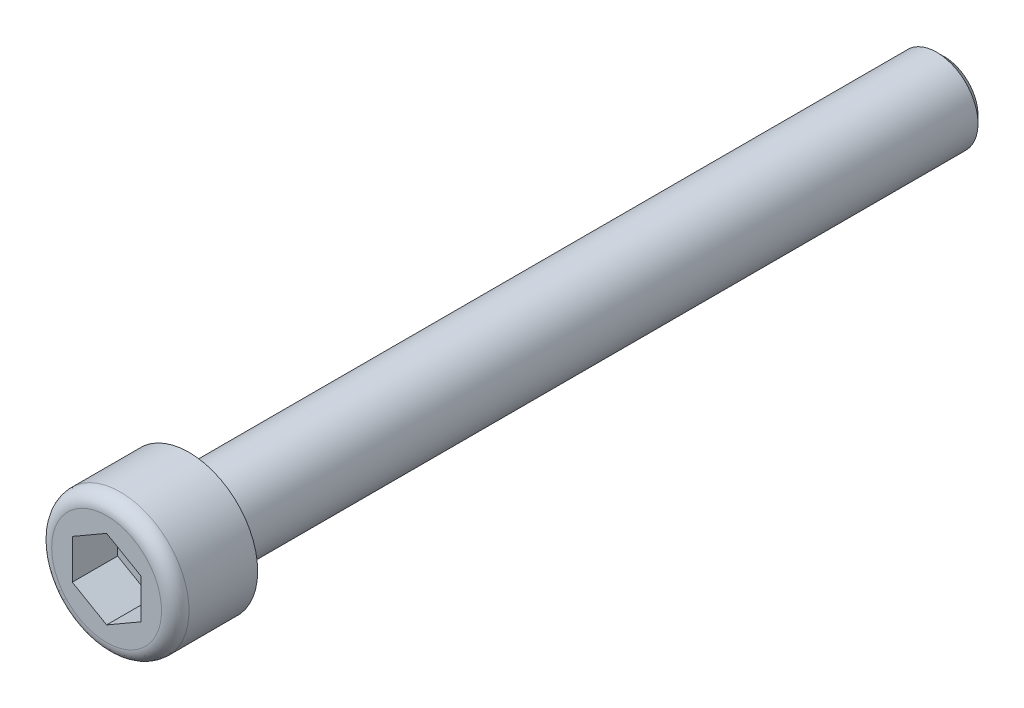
ISO-10303-21;
HEADER;
FILE_DESCRIPTION(('STEP AP214'),'2;1');
FILE_NAME('part.step','',(''),(''),'','','');
FILE_SCHEMA(('AUTOMOTIVE_DESIGN { 1 0 10303 214 1 1 1 1 }'));
ENDSEC;
DATA;
#1=APPLICATION_CONTEXT('core data for automotive mechanical design processes');
#2=APPLICATION_PROTOCOL_DEFINITION('international standard','automotive_design',2000,#1);
#3=PRODUCT_CONTEXT('',#1,'mechanical');
#4=PRODUCT('Part','Part','',(#3));
#5=PRODUCT_RELATED_PRODUCT_CATEGORY('part','',(#4));
#6=PRODUCT_DEFINITION_FORMATION('','',#4);
#7=PRODUCT_DEFINITION_CONTEXT('part definition',#1,'design');
#8=PRODUCT_DEFINITION('design','',#6,#7);
#9=PRODUCT_DEFINITION_SHAPE('','',#8);
#10=(LENGTH_UNIT() NAMED_UNIT(*) SI_UNIT(.MILLI.,.METRE.));
#11=(NAMED_UNIT(*) PLANE_ANGLE_UNIT() SI_UNIT($,.RADIAN.));
#12=(NAMED_UNIT(*) SI_UNIT($,.STERADIAN.) SOLID_ANGLE_UNIT());
#13=UNCERTAINTY_MEASURE_WITH_UNIT(LENGTH_MEASURE(1.E-05),#10,'distance_accuracy_value','');
#14=(GEOMETRIC_REPRESENTATION_CONTEXT(3) GLOBAL_UNCERTAINTY_ASSIGNED_CONTEXT((#13)) GLOBAL_UNIT_ASSIGNED_CONTEXT((#10,
#11,#12)) REPRESENTATION_CONTEXT('',''));
#15=CARTESIAN_POINT('',(0.,0.,0.));
#16=DIRECTION('',(0.,0.,1.));
#17=DIRECTION('',(1.,0.,0.));
#18=AXIS2_PLACEMENT_3D('',#15,#16,#17);
#19=CARTESIAN_POINT('',(0.,0.,0.));
#20=DIRECTION('',(0.,0.,-1.));
#21=DIRECTION('',(0.,1.,0.));
#22=AXIS2_PLACEMENT_3D('',#19,#20,#21);
#23=CYLINDRICAL_SURFACE('',#22,3.);
#24=CARTESIAN_POINT('',(0.,0.,0.));
#25=DIRECTION('',(0.,0.,-1.));
#26=DIRECTION('',(0.,1.,0.));
#27=AXIS2_PLACEMENT_3D('',#24,#25,#26);
#28=CIRCLE('',#27,3.);
#29=CARTESIAN_POINT('',(0.,3.,0.));
#30=VERTEX_POINT('',#29);
#31=EDGE_CURVE('E9',#30,#30,#28,.T.);
#32=ORIENTED_EDGE('',*,*,#31,.T.);
#33=EDGE_LOOP('',(#32));
#34=FACE_BOUND('',#33,.T.);
#35=CARTESIAN_POINT('',(0.,1.90141819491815E-13,-54.45875));
#36=DIRECTION('',(0.,0.,-1.));
#37=DIRECTION('',(-1.,0.,0.));
#38=AXIS2_PLACEMENT_3D('',#35,#36,#37);
#39=CIRCLE('',#38,3.);
#40=CARTESIAN_POINT('',(-3.,1.90141819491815E-13,-54.45875));
#41=VERTEX_POINT('',#40);
#42=EDGE_CURVE('E108',#41,#41,#39,.T.);
#43=ORIENTED_EDGE('',*,*,#42,.F.);
#44=EDGE_LOOP('',(#43));
#45=FACE_BOUND('',#44,.T.);
#46=ADVANCED_FACE('F14',(#34,#45),#23,.T.);
#47=CARTESIAN_POINT('',(3.25,-3.315,0.));
#48=DIRECTION('',(0.,0.,-1.));
#49=DIRECTION('',(-1.,0.,0.));
#50=AXIS2_PLACEMENT_3D('',#47,#48,#49);
#51=PLANE('',#50);
#52=ORIENTED_EDGE('',*,*,#31,.F.);
#53=EDGE_LOOP('',(#52));
#54=FACE_BOUND('',#53,.T.);
#55=CARTESIAN_POINT('',(0.,0.,0.));
#56=DIRECTION('',(0.,0.,1.));
#57=DIRECTION('',(1.,0.,0.));
#58=AXIS2_PLACEMENT_3D('',#55,#56,#57);
#59=CIRCLE('',#58,5.);
#60=CARTESIAN_POINT('',(5.,0.,0.));
#61=VERTEX_POINT('',#60);
#62=EDGE_CURVE('E109',#61,#61,#59,.T.);
#63=ORIENTED_EDGE('',*,*,#62,.F.);
#64=EDGE_LOOP('',(#63));
#65=FACE_BOUND('',#64,.T.);
#66=ADVANCED_FACE('F16',(#54,#65),#51,.T.);
#67=CARTESIAN_POINT('',(-2.5,2.88675134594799,2.7));
#68=DIRECTION('',(0.,0.,-1.));
#69=DIRECTION('',(1.,0.,0.));
#70=AXIS2_PLACEMENT_3D('',#67,#68,#69);
#71=PLANE('',#70);
#72=DIRECTION('',(-0.866025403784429,0.500000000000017,0.));
#73=VECTOR('',#72,1.);
#74=CARTESIAN_POINT('',(1.24999999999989,2.16506350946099,2.7));
#75=LINE('',#74,#73);
#76=CARTESIAN_POINT('',(2.49999999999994,1.44337567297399,2.7));
#77=VERTEX_POINT('',#76);
#78=CARTESIAN_POINT('',(-6.98827145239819E-10,2.88675134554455,2.7));
#79=VERTEX_POINT('',#78);
#80=EDGE_CURVE('E157',#77,#79,#75,.T.);
#81=ORIENTED_EDGE('',*,*,#80,.T.);
#82=DIRECTION('',(-0.866025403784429,-0.500000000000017,0.));
#83=VECTOR('',#82,1.);
#84=CARTESIAN_POINT('',(-1.25000000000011,2.16506350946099,2.7));
#85=LINE('',#84,#83);
#86=CARTESIAN_POINT('',(-2.5,1.44337567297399,2.7));
#87=VERTEX_POINT('',#86);
#88=EDGE_CURVE('E154',#79,#87,#85,.T.);
#89=ORIENTED_EDGE('',*,*,#88,.T.);
#90=DIRECTION('',(0.,-1.,0.));
#91=VECTOR('',#90,1.);
#92=CARTESIAN_POINT('',(-2.5,0.,2.7));
#93=LINE('',#92,#91);
#94=CARTESIAN_POINT('',(-2.49999999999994,-1.44337567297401,2.7));
#95=VERTEX_POINT('',#94);
#96=EDGE_CURVE('E151',#87,#95,#93,.T.);
#97=ORIENTED_EDGE('',*,*,#96,.T.);
#98=DIRECTION('',(0.866025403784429,-0.500000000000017,0.));
#99=VECTOR('',#98,1.);
#100=CARTESIAN_POINT('',(-1.24999999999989,-2.16506350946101,2.7));
#101=LINE('',#100,#99);
#102=CARTESIAN_POINT('',(1.39759834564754E-09,-2.88675134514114,2.7));
#103=VERTEX_POINT('',#102);
#104=EDGE_CURVE('E101',#95,#103,#101,.T.);
#105=ORIENTED_EDGE('',*,*,#104,.T.);
#106=DIRECTION('',(0.866025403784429,0.500000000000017,0.));
#107=VECTOR('',#106,1.);
#108=CARTESIAN_POINT('',(1.25000000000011,-2.16506350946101,2.7));
#109=LINE('',#108,#107);
#110=CARTESIAN_POINT('',(2.5,-1.44337567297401,2.7));
#111=VERTEX_POINT('',#110);
#112=EDGE_CURVE('E86',#103,#111,#109,.T.);
#113=ORIENTED_EDGE('',*,*,#112,.T.);
#114=DIRECTION('',(0.,1.,0.));
#115=VECTOR('',#114,1.);
#116=CARTESIAN_POINT('',(2.5,0.,2.7));
#117=LINE('',#116,#115);
#118=EDGE_CURVE('E84',#111,#77,#117,.T.);
#119=ORIENTED_EDGE('',*,*,#118,.T.);
#120=EDGE_LOOP('',(#81,#89,#97,#105,#113,#119));
#121=FACE_BOUND('',#120,.T.);
#122=ADVANCED_FACE('F206',(#121),#71,.F.);
#123=CARTESIAN_POINT('',(0.,-2.88675134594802,6.));
#124=DIRECTION('',(-0.500000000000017,-0.866025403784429,0.));
#125=DIRECTION('',(-0.866025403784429,0.500000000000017,0.));
#126=AXIS2_PLACEMENT_3D('',#123,#124,#125);
#127=PLANE('',#126);
#128=ORIENTED_EDGE('',*,*,#104,.F.);
#129=DIRECTION('',(0.,0.,-1.));
#130=VECTOR('',#129,1.);
#131=CARTESIAN_POINT('',(-2.49999999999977,-1.44337567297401,4.35));
#132=LINE('',#131,#130);
#133=CARTESIAN_POINT('',(-2.49999999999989,-1.44337567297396,6.));
#134=VERTEX_POINT('',#133);
#135=EDGE_CURVE('E150',#134,#95,#132,.T.);
#136=ORIENTED_EDGE('',*,*,#135,.F.);
#137=DIRECTION('',(-0.866025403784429,0.500000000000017,0.));
#138=VECTOR('',#137,1.);
#139=CARTESIAN_POINT('',(0.,-2.88675134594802,6.));
#140=LINE('',#139,#138);
#141=CARTESIAN_POINT('',(0.,-2.88675134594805,6.));
#142=VERTEX_POINT('',#141);
#143=EDGE_CURVE('E194',#134,#142,#140,.F.);
#144=ORIENTED_EDGE('',*,*,#143,.T.);
#145=DIRECTION('',(0.,0.,1.));
#146=VECTOR('',#145,1.);
#147=CARTESIAN_POINT('',(0.,-2.88675134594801,4.35));
#148=LINE('',#147,#146);
#149=EDGE_CURVE('E98',#103,#142,#148,.T.);
#150=ORIENTED_EDGE('',*,*,#149,.F.);
#151=EDGE_LOOP('',(#128,#136,#144,#150));
#152=FACE_BOUND('',#151,.T.);
#153=ADVANCED_FACE('F176',(#152),#127,.F.);
#154=CARTESIAN_POINT('',(2.5,-1.44337567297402,6.));
#155=DIRECTION('',(0.500000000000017,-0.866025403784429,0.));
#156=DIRECTION('',(-0.866025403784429,-0.500000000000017,0.));
#157=AXIS2_PLACEMENT_3D('',#154,#155,#156);
#158=PLANE('',#157);
#159=ORIENTED_EDGE('',*,*,#112,.F.);
#160=ORIENTED_EDGE('',*,*,#149,.T.);
#161=DIRECTION('',(-0.866025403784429,-0.500000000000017,0.));
#162=VECTOR('',#161,1.);
#163=CARTESIAN_POINT('',(2.5,-1.44337567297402,6.));
#164=LINE('',#163,#162);
#165=CARTESIAN_POINT('',(2.5,-1.44337567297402,6.));
#166=VERTEX_POINT('',#165);
#167=EDGE_CURVE('E73',#142,#166,#164,.F.);
#168=ORIENTED_EDGE('',*,*,#167,.T.);
#169=DIRECTION('',(0.,0.,-1.));
#170=VECTOR('',#169,1.);
#171=CARTESIAN_POINT('',(2.5,-1.44337567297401,4.35));
#172=LINE('',#171,#170);
#173=EDGE_CURVE('E80',#166,#111,#172,.T.);
#174=ORIENTED_EDGE('',*,*,#173,.T.);
#175=EDGE_LOOP('',(#159,#160,#168,#174));
#176=FACE_BOUND('',#175,.T.);
#177=ADVANCED_FACE('F96',(#176),#158,.F.);
#178=CARTESIAN_POINT('',(2.5,1.44337567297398,6.));
#179=DIRECTION('',(1.,0.,0.));
#180=DIRECTION('',(0.,-1.,0.));
#181=AXIS2_PLACEMENT_3D('',#178,#179,#180);
#182=PLANE('',#181);
#183=ORIENTED_EDGE('',*,*,#118,.F.);
#184=ORIENTED_EDGE('',*,*,#173,.F.);
#185=DIRECTION('',(0.,1.,0.));
#186=VECTOR('',#185,1.);
#187=CARTESIAN_POINT('',(2.5,0.,6.));
#188=LINE('',#187,#186);
#189=CARTESIAN_POINT('',(2.49999999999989,1.44337567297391,6.));
#190=VERTEX_POINT('',#189);
#191=EDGE_CURVE('E83',#166,#190,#188,.T.);
#192=ORIENTED_EDGE('',*,*,#191,.T.);
#193=DIRECTION('',(0.,0.,-1.));
#194=VECTOR('',#193,1.);
#195=CARTESIAN_POINT('',(2.49999999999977,1.44337567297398,4.35));
#196=LINE('',#195,#194);
#197=EDGE_CURVE('E159',#190,#77,#196,.T.);
#198=ORIENTED_EDGE('',*,*,#197,.T.);
#199=EDGE_LOOP('',(#183,#184,#192,#198));
#200=FACE_BOUND('',#199,.T.);
#201=ADVANCED_FACE('F81',(#200),#182,.F.);
#202=CARTESIAN_POINT('',(0.,2.88675134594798,6.));
#203=DIRECTION('',(0.500000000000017,0.866025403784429,0.));
#204=DIRECTION('',(0.866025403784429,-0.500000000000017,0.));
#205=AXIS2_PLACEMENT_3D('',#202,#203,#204);
#206=PLANE('',#205);
#207=ORIENTED_EDGE('',*,*,#80,.F.);
#208=ORIENTED_EDGE('',*,*,#197,.F.);
#209=DIRECTION('',(0.866025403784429,-0.500000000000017,0.));
#210=VECTOR('',#209,1.);
#211=CARTESIAN_POINT('',(0.,2.88675134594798,6.));
#212=LINE('',#211,#210);
#213=CARTESIAN_POINT('',(-1.67119233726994E-13,2.88675134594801,6.));
#214=VERTEX_POINT('',#213);
#215=EDGE_CURVE('E94',#190,#214,#212,.F.);
#216=ORIENTED_EDGE('',*,*,#215,.T.);
#217=DIRECTION('',(0.,0.,-1.));
#218=VECTOR('',#217,1.);
#219=CARTESIAN_POINT('',(-2.2291196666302E-13,2.88675134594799,4.35));
#220=LINE('',#219,#218);
#221=EDGE_CURVE('E156',#214,#79,#220,.T.);
#222=ORIENTED_EDGE('',*,*,#221,.T.);
#223=EDGE_LOOP('',(#207,#208,#216,#222));
#224=FACE_BOUND('',#223,.T.);
#225=ADVANCED_FACE('F203',(#224),#206,.F.);
#226=CARTESIAN_POINT('',(-2.5,1.44337567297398,6.));
#227=DIRECTION('',(-0.500000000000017,0.866025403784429,0.));
#228=DIRECTION('',(0.866025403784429,0.500000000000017,0.));
#229=AXIS2_PLACEMENT_3D('',#226,#227,#228);
#230=PLANE('',#229);
#231=ORIENTED_EDGE('',*,*,#88,.F.);
#232=ORIENTED_EDGE('',*,*,#221,.F.);
#233=DIRECTION('',(0.866025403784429,0.500000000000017,0.));
#234=VECTOR('',#233,1.);
#235=CARTESIAN_POINT('',(-2.5,1.44337567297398,6.));
#236=LINE('',#235,#234);
#237=CARTESIAN_POINT('',(-2.5,1.44337567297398,6.));
#238=VERTEX_POINT('',#237);
#239=EDGE_CURVE('E195',#214,#238,#236,.F.);
#240=ORIENTED_EDGE('',*,*,#239,.T.);
#241=DIRECTION('',(0.,0.,-1.));
#242=VECTOR('',#241,1.);
#243=CARTESIAN_POINT('',(-2.5,1.44337567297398,4.35));
#244=LINE('',#243,#242);
#245=EDGE_CURVE('E153',#238,#87,#244,.T.);
#246=ORIENTED_EDGE('',*,*,#245,.T.);
#247=EDGE_LOOP('',(#231,#232,#240,#246));
#248=FACE_BOUND('',#247,.T.);
#249=ADVANCED_FACE('F208',(#248),#230,.F.);
#250=CARTESIAN_POINT('',(-2.5,-1.44337567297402,6.));
#251=DIRECTION('',(-1.,0.,0.));
#252=DIRECTION('',(0.,1.,0.));
#253=AXIS2_PLACEMENT_3D('',#250,#251,#252);
#254=PLANE('',#253);
#255=ORIENTED_EDGE('',*,*,#96,.F.);
#256=ORIENTED_EDGE('',*,*,#245,.F.);
#257=DIRECTION('',(0.,-1.,0.));
#258=VECTOR('',#257,1.);
#259=CARTESIAN_POINT('',(-2.5,0.,6.));
#260=LINE('',#259,#258);
#261=EDGE_CURVE('E191',#238,#134,#260,.T.);
#262=ORIENTED_EDGE('',*,*,#261,.T.);
#263=ORIENTED_EDGE('',*,*,#135,.T.);
#264=EDGE_LOOP('',(#255,#256,#262,#263));
#265=FACE_BOUND('',#264,.T.);
#266=ADVANCED_FACE('F175',(#265),#254,.F.);
#267=CARTESIAN_POINT('',(4.,-4.08,6.));
#268=DIRECTION('',(0.,0.,-1.));
#269=DIRECTION('',(-1.,0.,0.));
#270=AXIS2_PLACEMENT_3D('',#267,#268,#269);
#271=PLANE('',#270);
#272=ORIENTED_EDGE('',*,*,#261,.F.);
#273=ORIENTED_EDGE('',*,*,#239,.F.);
#274=ORIENTED_EDGE('',*,*,#215,.F.);
#275=ORIENTED_EDGE('',*,*,#191,.F.);
#276=ORIENTED_EDGE('',*,*,#167,.F.);
#277=ORIENTED_EDGE('',*,*,#143,.F.);
#278=EDGE_LOOP('',(#272,#273,#274,#275,#276,#277));
#279=FACE_BOUND('',#278,.T.);
#280=CARTESIAN_POINT('',(0.,0.,6.));
#281=DIRECTION('',(0.,0.,-1.));
#282=DIRECTION('',(-1.,0.,0.));
#283=AXIS2_PLACEMENT_3D('',#280,#281,#282);
#284=CIRCLE('',#283,4.);
#285=CARTESIAN_POINT('',(4.,0.,6.));
#286=VERTEX_POINT('',#285);
#287=CARTESIAN_POINT('',(-4.,0.,6.));
#288=VERTEX_POINT('',#287);
#289=EDGE_CURVE('E121',#286,#288,#284,.F.);
#290=ORIENTED_EDGE('',*,*,#289,.T.);
#291=CARTESIAN_POINT('',(0.,0.,6.));
#292=DIRECTION('',(0.,0.,-1.));
#293=DIRECTION('',(1.,0.,0.));
#294=AXIS2_PLACEMENT_3D('',#291,#292,#293);
#295=CIRCLE('',#294,4.);
#296=EDGE_CURVE('E34',#288,#286,#295,.F.);
#297=ORIENTED_EDGE('',*,*,#296,.T.);
#298=EDGE_LOOP('',(#290,#297));
#299=FACE_BOUND('',#298,.T.);
#300=ADVANCED_FACE('F90',(#279,#299),#271,.F.);
#301=CARTESIAN_POINT('',(-4.,0.,6.));
#302=CARTESIAN_POINT('',(-4.5857864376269,0.,6.));
#303=CARTESIAN_POINT('',(-5.,0.,5.58578643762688));
#304=CARTESIAN_POINT('',(-5.,0.,5.));
#305=(BOUNDED_CURVE() B_SPLINE_CURVE(3,(#301,#302,#303,#304),.UNSPECIFIED.,.F.,
.F.) B_SPLINE_CURVE_WITH_KNOTS((4,4),(0.,1.),
.UNSPECIFIED.) CURVE() GEOMETRIC_REPRESENTATION_ITEM() RATIONAL_B_SPLINE_CURVE((1.,
0.804737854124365,0.804737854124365,1.)) REPRESENTATION_ITEM(''));
#306=CARTESIAN_POINT('',(0.,0.,5.));
#307=DIRECTION('',(0.,0.,-1.));
#308=AXIS1_PLACEMENT('',#306,#307);
#309=SURFACE_OF_REVOLUTION('',#305,#308);
#310=ORIENTED_EDGE('',*,*,#289,.F.);
#311=ORIENTED_EDGE('',*,*,#296,.F.);
#312=EDGE_LOOP('',(#310,#311));
#313=FACE_BOUND('',#312,.T.);
#314=CARTESIAN_POINT('',(0.,0.,5.));
#315=DIRECTION('',(0.,0.,-1.));
#316=DIRECTION('',(-1.,0.,0.));
#317=AXIS2_PLACEMENT_3D('',#314,#315,#316);
#318=CIRCLE('',#317,5.);
#319=CARTESIAN_POINT('',(-5.,0.,5.));
#320=VERTEX_POINT('',#319);
#321=EDGE_CURVE('E26',#320,#320,#318,.F.);
#322=ORIENTED_EDGE('',*,*,#321,.T.);
#323=EDGE_LOOP('',(#322));
#324=FACE_BOUND('',#323,.T.);
#325=ADVANCED_FACE('F130',(#313,#324),#309,.T.);
#326=CARTESIAN_POINT('',(0.,0.,5.));
#327=DIRECTION('',(0.,0.,-1.));
#328=DIRECTION('',(0.,1.,0.));
#329=AXIS2_PLACEMENT_3D('',#326,#327,#328);
#330=CYLINDRICAL_SURFACE('',#329,5.);
#331=ORIENTED_EDGE('',*,*,#321,.F.);
#332=EDGE_LOOP('',(#331));
#333=FACE_BOUND('',#332,.T.);
#334=ORIENTED_EDGE('',*,*,#62,.T.);
#335=EDGE_LOOP('',(#334));
#336=FACE_BOUND('',#335,.T.);
#337=ADVANCED_FACE('F135',(#333,#336),#330,.T.);
#338=CARTESIAN_POINT('',(2.45875,-2.5079249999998,-55.));
#339=DIRECTION('',(0.,0.,-1.));
#340=DIRECTION('',(-1.,0.,0.));
#341=AXIS2_PLACEMENT_3D('',#338,#339,#340);
#342=PLANE('',#341);
#343=CARTESIAN_POINT('',(0.,1.92031584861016E-13,-55.));
#344=DIRECTION('',(0.,0.,1.));
#345=DIRECTION('',(-1.,0.,0.));
#346=AXIS2_PLACEMENT_3D('',#343,#344,#345);
#347=CIRCLE('',#346,2.45875);
#348=CARTESIAN_POINT('',(-2.45875000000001,1.92031584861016E-13,-55.));
#349=VERTEX_POINT('',#348);
#350=EDGE_CURVE('E106',#349,#349,#347,.F.);
#351=ORIENTED_EDGE('',*,*,#350,.T.);
#352=EDGE_LOOP('',(#351));
#353=FACE_BOUND('',#352,.T.);
#354=ADVANCED_FACE('F233',(#353),#342,.T.);
#355=CARTESIAN_POINT('',(0.,1.90141819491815E-13,-54.45875));
#356=DIRECTION('',(0.,0.,1.));
#357=DIRECTION('',(-1.,0.,0.));
#358=AXIS2_PLACEMENT_3D('',#355,#356,#357);
#359=CONICAL_SURFACE('',#358,3.,0.785398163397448);
#360=ORIENTED_EDGE('',*,*,#42,.T.);
#361=EDGE_LOOP('',(#360));
#362=FACE_BOUND('',#361,.T.);
#363=ORIENTED_EDGE('',*,*,#350,.F.);
#364=EDGE_LOOP('',(#363));
#365=FACE_BOUND('',#364,.T.);
#366=ADVANCED_FACE('F137',(#362,#365),#359,.T.);
#367=CLOSED_SHELL('',(#46,#66,#122,#153,#177,#201,#225,#249,#266,#300,#325,#337,#354,#366));
#368=MANIFOLD_SOLID_BREP('B1',#367);
#369=ADVANCED_BREP_SHAPE_REPRESENTATION('',(#18,#368),#14);
#370=SHAPE_DEFINITION_REPRESENTATION(#9,#369);
ENDSEC;
END-ISO-10303-21;
